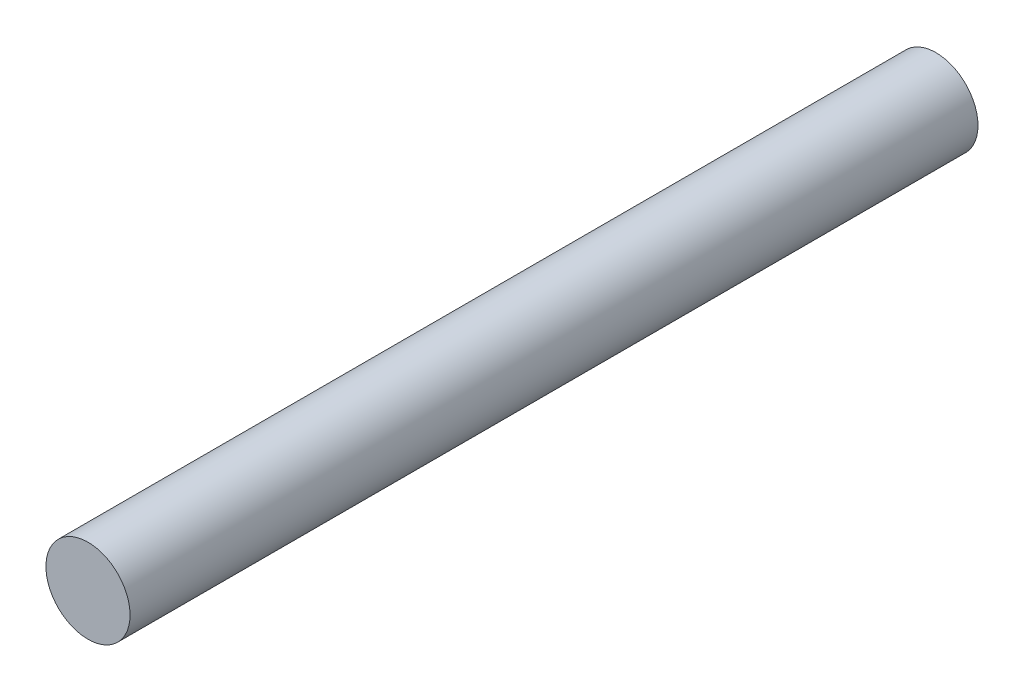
ISO-10303-21;
HEADER;
FILE_DESCRIPTION(('STEP AP214'),'2;1');
FILE_NAME('part.step','',(''),(''),'','','');
FILE_SCHEMA(('AUTOMOTIVE_DESIGN { 1 0 10303 214 1 1 1 1 }'));
ENDSEC;
DATA;
#1=APPLICATION_CONTEXT('core data for automotive mechanical design processes');
#2=APPLICATION_PROTOCOL_DEFINITION('international standard','automotive_design',2000,#1);
#3=PRODUCT_CONTEXT('',#1,'mechanical');
#4=PRODUCT('Part','Part','',(#3));
#5=PRODUCT_RELATED_PRODUCT_CATEGORY('part','',(#4));
#6=PRODUCT_DEFINITION_FORMATION('','',#4);
#7=PRODUCT_DEFINITION_CONTEXT('part definition',#1,'design');
#8=PRODUCT_DEFINITION('design','',#6,#7);
#9=PRODUCT_DEFINITION_SHAPE('','',#8);
#10=(LENGTH_UNIT() NAMED_UNIT(*) SI_UNIT(.MILLI.,.METRE.));
#11=(NAMED_UNIT(*) PLANE_ANGLE_UNIT() SI_UNIT($,.RADIAN.));
#12=(NAMED_UNIT(*) SI_UNIT($,.STERADIAN.) SOLID_ANGLE_UNIT());
#13=UNCERTAINTY_MEASURE_WITH_UNIT(LENGTH_MEASURE(1.E-05),#10,'distance_accuracy_value','');
#14=(GEOMETRIC_REPRESENTATION_CONTEXT(3) GLOBAL_UNCERTAINTY_ASSIGNED_CONTEXT((#13)) GLOBAL_UNIT_ASSIGNED_CONTEXT((#10,
#11,#12)) REPRESENTATION_CONTEXT('',''));
#15=CARTESIAN_POINT('',(0.,0.,0.));
#16=DIRECTION('',(0.,0.,1.));
#17=DIRECTION('',(1.,0.,0.));
#18=AXIS2_PLACEMENT_3D('',#15,#16,#17);
#19=CARTESIAN_POINT('',(0.,0.,504.));
#20=DIRECTION('',(0.,0.,-1.));
#21=DIRECTION('',(-1.,0.,0.));
#22=AXIS2_PLACEMENT_3D('',#19,#20,#21);
#23=CYLINDRICAL_SURFACE('',#22,25.);
#24=CARTESIAN_POINT('',(0.,0.,504.));
#25=DIRECTION('',(0.,0.,1.));
#26=DIRECTION('',(1.,0.,0.));
#27=AXIS2_PLACEMENT_3D('',#24,#25,#26);
#28=CIRCLE('',#27,25.);
#29=CARTESIAN_POINT('',(25.,0.,504.));
#30=VERTEX_POINT('',#29);
#31=EDGE_CURVE('E10',#30,#30,#28,.T.);
#32=ORIENTED_EDGE('',*,*,#31,.F.);
#33=EDGE_LOOP('',(#32));
#34=FACE_BOUND('',#33,.T.);
#35=CARTESIAN_POINT('',(0.,0.,0.));
#36=DIRECTION('',(0.,0.,1.));
#37=DIRECTION('',(1.,0.,0.));
#38=AXIS2_PLACEMENT_3D('',#35,#36,#37);
#39=CIRCLE('',#38,25.);
#40=CARTESIAN_POINT('',(25.,0.,0.));
#41=VERTEX_POINT('',#40);
#42=EDGE_CURVE('E34',#41,#41,#39,.T.);
#43=ORIENTED_EDGE('',*,*,#42,.T.);
#44=EDGE_LOOP('',(#43));
#45=FACE_BOUND('',#44,.T.);
#46=ADVANCED_FACE('F31',(#34,#45),#23,.T.);
#47=CARTESIAN_POINT('',(0.,0.,504.));
#48=DIRECTION('',(0.,0.,1.));
#49=DIRECTION('',(1.,0.,0.));
#50=AXIS2_PLACEMENT_3D('',#47,#48,#49);
#51=PLANE('',#50);
#52=ORIENTED_EDGE('',*,*,#31,.T.);
#53=EDGE_LOOP('',(#52));
#54=FACE_BOUND('',#53,.T.);
#55=ADVANCED_FACE('F46',(#54),#51,.T.);
#56=CARTESIAN_POINT('',(0.,0.,0.));
#57=DIRECTION('',(0.,0.,1.));
#58=DIRECTION('',(1.,0.,0.));
#59=AXIS2_PLACEMENT_3D('',#56,#57,#58);
#60=PLANE('',#59);
#61=ORIENTED_EDGE('',*,*,#42,.F.);
#62=EDGE_LOOP('',(#61));
#63=FACE_BOUND('',#62,.T.);
#64=ADVANCED_FACE('F44',(#63),#60,.F.);
#65=CLOSED_SHELL('',(#46,#55,#64));
#66=MANIFOLD_SOLID_BREP('B2',#65);
#67=ADVANCED_BREP_SHAPE_REPRESENTATION('',(#18,#66),#14);
#68=SHAPE_DEFINITION_REPRESENTATION(#9,#67);
ENDSEC;
END-ISO-10303-21;
